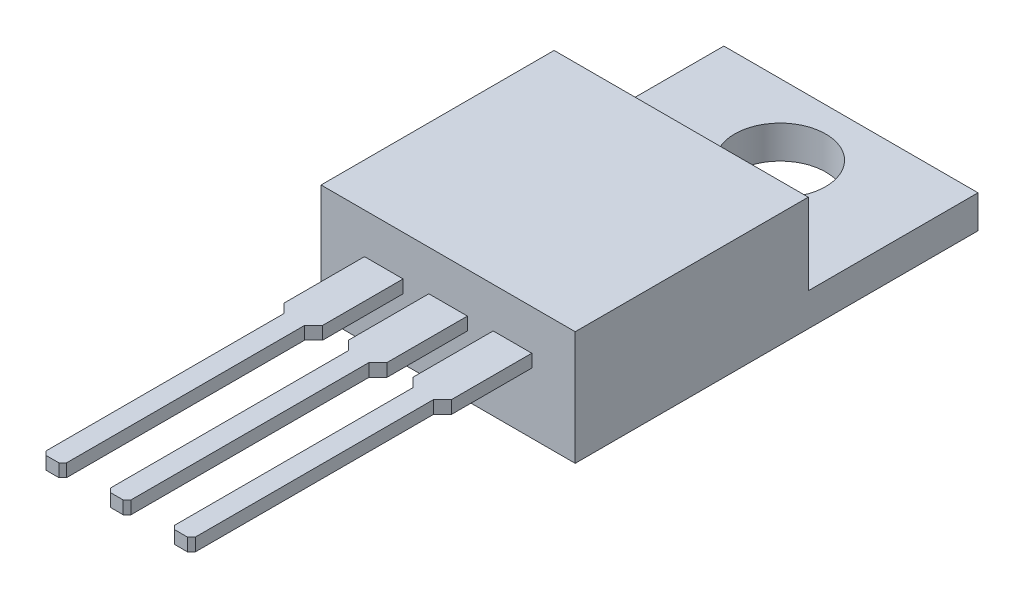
ISO-10303-21;
HEADER;
FILE_DESCRIPTION(('STEP AP214'),'2;1');
FILE_NAME('part.step','',(''),(''),'','','');
FILE_SCHEMA(('AUTOMOTIVE_DESIGN { 1 0 10303 214 1 1 1 1 }'));
ENDSEC;
DATA;
#1=APPLICATION_CONTEXT('core data for automotive mechanical design processes');
#2=APPLICATION_PROTOCOL_DEFINITION('international standard','automotive_design',2000,#1);
#3=PRODUCT_CONTEXT('',#1,'mechanical');
#4=PRODUCT('Part','Part','',(#3));
#5=PRODUCT_RELATED_PRODUCT_CATEGORY('part','',(#4));
#6=PRODUCT_DEFINITION_FORMATION('','',#4);
#7=PRODUCT_DEFINITION_CONTEXT('part definition',#1,'design');
#8=PRODUCT_DEFINITION('design','',#6,#7);
#9=PRODUCT_DEFINITION_SHAPE('','',#8);
#10=(LENGTH_UNIT() NAMED_UNIT(*) SI_UNIT(.MILLI.,.METRE.));
#11=(NAMED_UNIT(*) PLANE_ANGLE_UNIT() SI_UNIT($,.RADIAN.));
#12=(NAMED_UNIT(*) SI_UNIT($,.STERADIAN.) SOLID_ANGLE_UNIT());
#13=UNCERTAINTY_MEASURE_WITH_UNIT(LENGTH_MEASURE(1.E-05),#10,'distance_accuracy_value','');
#14=(GEOMETRIC_REPRESENTATION_CONTEXT(3) GLOBAL_UNCERTAINTY_ASSIGNED_CONTEXT((#13)) GLOBAL_UNIT_ASSIGNED_CONTEXT((#10,
#11,#12)) REPRESENTATION_CONTEXT('',''));
#15=CARTESIAN_POINT('',(0.,0.,0.));
#16=DIRECTION('',(0.,0.,1.));
#17=DIRECTION('',(1.,0.,0.));
#18=AXIS2_PLACEMENT_3D('',#15,#16,#17);
#19=CARTESIAN_POINT('',(-5.0165,1.30048,13.1064));
#20=DIRECTION('',(0.,0.,-1.));
#21=DIRECTION('',(-1.,0.,0.));
#22=AXIS2_PLACEMENT_3D('',#19,#20,#21);
#23=PLANE('',#22);
#24=DIRECTION('',(0.,-1.,0.));
#25=VECTOR('',#24,1.);
#26=CARTESIAN_POINT('',(-0.761999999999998,2.9083,13.1064));
#27=LINE('',#26,#25);
#28=CARTESIAN_POINT('',(-0.761999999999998,2.9083,13.1064));
#29=VERTEX_POINT('',#28);
#30=CARTESIAN_POINT('',(-0.761999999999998,2.4003,13.1064));
#31=VERTEX_POINT('',#30);
#32=EDGE_CURVE('E303',#29,#31,#27,.T.);
#33=ORIENTED_EDGE('',*,*,#32,.F.);
#34=DIRECTION('',(-1.,0.,0.));
#35=VECTOR('',#34,1.);
#36=CARTESIAN_POINT('',(-0.761999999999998,2.9083,13.1064));
#37=LINE('',#36,#35);
#38=CARTESIAN_POINT('',(0.762000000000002,2.9083,13.1064));
#39=VERTEX_POINT('',#38);
#40=EDGE_CURVE('E312',#39,#29,#37,.T.);
#41=ORIENTED_EDGE('',*,*,#40,.F.);
#42=DIRECTION('',(0.,1.,0.));
#43=VECTOR('',#42,1.);
#44=CARTESIAN_POINT('',(0.762000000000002,2.9083,13.1064));
#45=LINE('',#44,#43);
#46=CARTESIAN_POINT('',(0.762000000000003,2.4003,13.1064));
#47=VERTEX_POINT('',#46);
#48=EDGE_CURVE('E309',#47,#39,#45,.T.);
#49=ORIENTED_EDGE('',*,*,#48,.F.);
#50=DIRECTION('',(1.,0.,0.));
#51=VECTOR('',#50,1.);
#52=CARTESIAN_POINT('',(-0.761999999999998,2.4003,13.1064));
#53=LINE('',#52,#51);
#54=EDGE_CURVE('E306',#31,#47,#53,.T.);
#55=ORIENTED_EDGE('',*,*,#54,.F.);
#56=EDGE_LOOP('',(#33,#41,#49,#55));
#57=FACE_BOUND('',#56,.T.);
#58=DIRECTION('',(1.,0.,0.));
#59=VECTOR('',#58,1.);
#60=CARTESIAN_POINT('',(-5.0165,0.,13.1064));
#61=LINE('',#60,#59);
#62=CARTESIAN_POINT('',(-5.0165,0.,13.1064));
#63=VERTEX_POINT('',#62);
#64=CARTESIAN_POINT('',(5.0165,0.,13.1064));
#65=VERTEX_POINT('',#64);
#66=EDGE_CURVE('E1022',#63,#65,#61,.T.);
#67=ORIENTED_EDGE('',*,*,#66,.T.);
#68=DIRECTION('',(0.,-1.,0.));
#69=VECTOR('',#68,1.);
#70=CARTESIAN_POINT('',(5.0165,1.30048,13.1064));
#71=LINE('',#70,#69);
#72=CARTESIAN_POINT('',(5.0165,4.50088,13.1064));
#73=VERTEX_POINT('',#72);
#74=EDGE_CURVE('E1035',#73,#65,#71,.T.);
#75=ORIENTED_EDGE('',*,*,#74,.F.);
#76=DIRECTION('',(1.,0.,0.));
#77=VECTOR('',#76,1.);
#78=CARTESIAN_POINT('',(-5.0165,4.50088,13.1064));
#79=LINE('',#78,#77);
#80=CARTESIAN_POINT('',(-5.0165,4.50088,13.1064));
#81=VERTEX_POINT('',#80);
#82=EDGE_CURVE('E1006',#81,#73,#79,.T.);
#83=ORIENTED_EDGE('',*,*,#82,.F.);
#84=DIRECTION('',(0.,-1.,0.));
#85=VECTOR('',#84,1.);
#86=CARTESIAN_POINT('',(-5.0165,1.30048,13.1064));
#87=LINE('',#86,#85);
#88=EDGE_CURVE('E382',#81,#63,#87,.T.);
#89=ORIENTED_EDGE('',*,*,#88,.T.);
#90=EDGE_LOOP('',(#67,#75,#83,#89));
#91=FACE_BOUND('',#90,.T.);
#92=DIRECTION('',(0.,-1.,0.));
#93=VECTOR('',#92,1.);
#94=CARTESIAN_POINT('',(-3.302,2.9083,13.1064));
#95=LINE('',#94,#93);
#96=CARTESIAN_POINT('',(-3.302,2.9083,13.1064));
#97=VERTEX_POINT('',#96);
#98=CARTESIAN_POINT('',(-3.302,2.4003,13.1064));
#99=VERTEX_POINT('',#98);
#100=EDGE_CURVE('E329',#97,#99,#95,.T.);
#101=ORIENTED_EDGE('',*,*,#100,.F.);
#102=DIRECTION('',(-1.,0.,0.));
#103=VECTOR('',#102,1.);
#104=CARTESIAN_POINT('',(-3.302,2.9083,13.1064));
#105=LINE('',#104,#103);
#106=CARTESIAN_POINT('',(-1.778,2.9083,13.1064));
#107=VERTEX_POINT('',#106);
#108=EDGE_CURVE('E338',#107,#97,#105,.T.);
#109=ORIENTED_EDGE('',*,*,#108,.F.);
#110=DIRECTION('',(0.,1.,0.));
#111=VECTOR('',#110,1.);
#112=CARTESIAN_POINT('',(-1.778,2.9083,13.1064));
#113=LINE('',#112,#111);
#114=CARTESIAN_POINT('',(-1.778,2.4003,13.1064));
#115=VERTEX_POINT('',#114);
#116=EDGE_CURVE('E335',#115,#107,#113,.T.);
#117=ORIENTED_EDGE('',*,*,#116,.F.);
#118=DIRECTION('',(1.,0.,0.));
#119=VECTOR('',#118,1.);
#120=CARTESIAN_POINT('',(-3.302,2.4003,13.1064));
#121=LINE('',#120,#119);
#122=EDGE_CURVE('E332',#99,#115,#121,.T.);
#123=ORIENTED_EDGE('',*,*,#122,.F.);
#124=EDGE_LOOP('',(#101,#109,#117,#123));
#125=FACE_BOUND('',#124,.T.);
#126=DIRECTION('',(0.,-1.,0.));
#127=VECTOR('',#126,1.);
#128=CARTESIAN_POINT('',(1.778,2.9083,13.1064));
#129=LINE('',#128,#127);
#130=CARTESIAN_POINT('',(1.778,2.9083,13.1064));
#131=VERTEX_POINT('',#130);
#132=CARTESIAN_POINT('',(1.778,2.4003,13.1064));
#133=VERTEX_POINT('',#132);
#134=EDGE_CURVE('E499',#131,#133,#129,.T.);
#135=ORIENTED_EDGE('',*,*,#134,.F.);
#136=DIRECTION('',(-1.,0.,0.));
#137=VECTOR('',#136,1.);
#138=CARTESIAN_POINT('',(1.778,2.9083,13.1064));
#139=LINE('',#138,#137);
#140=CARTESIAN_POINT('',(3.302,2.9083,13.1064));
#141=VERTEX_POINT('',#140);
#142=EDGE_CURVE('E506',#141,#131,#139,.T.);
#143=ORIENTED_EDGE('',*,*,#142,.F.);
#144=DIRECTION('',(0.,1.,0.));
#145=VECTOR('',#144,1.);
#146=CARTESIAN_POINT('',(3.302,2.9083,13.1064));
#147=LINE('',#146,#145);
#148=CARTESIAN_POINT('',(3.302,2.4003,13.1064));
#149=VERTEX_POINT('',#148);
#150=EDGE_CURVE('E292',#149,#141,#147,.T.);
#151=ORIENTED_EDGE('',*,*,#150,.F.);
#152=DIRECTION('',(1.,0.,0.));
#153=VECTOR('',#152,1.);
#154=CARTESIAN_POINT('',(1.778,2.4003,13.1064));
#155=LINE('',#154,#153);
#156=EDGE_CURVE('E502',#133,#149,#155,.T.);
#157=ORIENTED_EDGE('',*,*,#156,.F.);
#158=EDGE_LOOP('',(#135,#143,#151,#157));
#159=FACE_BOUND('',#158,.T.);
#160=ADVANCED_FACE('F32',(#57,#91,#125,#159),#23,.F.);
#161=CARTESIAN_POINT('',(-5.0165,1.30048,-2.794));
#162=DIRECTION('',(1.,0.,0.));
#163=DIRECTION('',(0.,0.,-1.));
#164=AXIS2_PLACEMENT_3D('',#161,#162,#163);
#165=PLANE('',#164);
#166=DIRECTION('',(0.,0.,1.));
#167=VECTOR('',#166,1.);
#168=CARTESIAN_POINT('',(-5.0165,0.,-2.794));
#169=LINE('',#168,#167);
#170=CARTESIAN_POINT('',(-5.0165,0.,-2.794));
#171=VERTEX_POINT('',#170);
#172=EDGE_CURVE('E1019',#171,#63,#169,.T.);
#173=ORIENTED_EDGE('',*,*,#172,.T.);
#174=ORIENTED_EDGE('',*,*,#88,.F.);
#175=DIRECTION('',(0.,0.,1.));
#176=VECTOR('',#175,1.);
#177=CARTESIAN_POINT('',(-5.0165,4.50088,13.1064));
#178=LINE('',#177,#176);
#179=CARTESIAN_POINT('',(-5.0165,4.50088,3.90652));
#180=VERTEX_POINT('',#179);
#181=EDGE_CURVE('E358',#180,#81,#178,.T.);
#182=ORIENTED_EDGE('',*,*,#181,.F.);
#183=DIRECTION('',(0.,-1.,0.));
#184=VECTOR('',#183,1.);
#185=CARTESIAN_POINT('',(-5.0165,4.50088,3.90652));
#186=LINE('',#185,#184);
#187=CARTESIAN_POINT('',(-5.0165,1.30048,3.90652));
#188=VERTEX_POINT('',#187);
#189=EDGE_CURVE('E367',#180,#188,#186,.T.);
#190=ORIENTED_EDGE('',*,*,#189,.T.);
#191=DIRECTION('',(0.,0.,1.));
#192=VECTOR('',#191,1.);
#193=CARTESIAN_POINT('',(-5.0165,1.30048,-2.794));
#194=LINE('',#193,#192);
#195=CARTESIAN_POINT('',(-5.0165,1.30048,-2.794));
#196=VERTEX_POINT('',#195);
#197=EDGE_CURVE('E1028',#196,#188,#194,.T.);
#198=ORIENTED_EDGE('',*,*,#197,.F.);
#199=DIRECTION('',(0.,-1.,0.));
#200=VECTOR('',#199,1.);
#201=CARTESIAN_POINT('',(-5.0165,1.30048,-2.794));
#202=LINE('',#201,#200);
#203=EDGE_CURVE('E1041',#196,#171,#202,.T.);
#204=ORIENTED_EDGE('',*,*,#203,.T.);
#205=EDGE_LOOP('',(#173,#174,#182,#190,#198,#204));
#206=FACE_BOUND('',#205,.T.);
#207=ADVANCED_FACE('F34',(#206),#165,.F.);
#208=CARTESIAN_POINT('',(5.0165,1.30048,-2.794));
#209=DIRECTION('',(-1.,0.,0.));
#210=DIRECTION('',(0.,0.,1.));
#211=AXIS2_PLACEMENT_3D('',#208,#209,#210);
#212=PLANE('',#211);
#213=DIRECTION('',(0.,0.,-1.));
#214=VECTOR('',#213,1.);
#215=CARTESIAN_POINT('',(5.0165,0.,-2.794));
#216=LINE('',#215,#214);
#217=CARTESIAN_POINT('',(5.0165,0.,-2.794));
#218=VERTEX_POINT('',#217);
#219=EDGE_CURVE('E1024',#65,#218,#216,.T.);
#220=ORIENTED_EDGE('',*,*,#219,.T.);
#221=DIRECTION('',(0.,-1.,0.));
#222=VECTOR('',#221,1.);
#223=CARTESIAN_POINT('',(5.0165,1.30048,-2.794));
#224=LINE('',#223,#222);
#225=CARTESIAN_POINT('',(5.0165,1.30048,-2.794));
#226=VERTEX_POINT('',#225);
#227=EDGE_CURVE('E1038',#226,#218,#224,.T.);
#228=ORIENTED_EDGE('',*,*,#227,.F.);
#229=DIRECTION('',(0.,0.,-1.));
#230=VECTOR('',#229,1.);
#231=CARTESIAN_POINT('',(5.0165,1.30048,-2.794));
#232=LINE('',#231,#230);
#233=CARTESIAN_POINT('',(5.0165,1.30048,3.90652));
#234=VERTEX_POINT('',#233);
#235=EDGE_CURVE('E364',#234,#226,#232,.T.);
#236=ORIENTED_EDGE('',*,*,#235,.F.);
#237=DIRECTION('',(0.,-1.,0.));
#238=VECTOR('',#237,1.);
#239=CARTESIAN_POINT('',(5.0165,4.50088,3.90652));
#240=LINE('',#239,#238);
#241=CARTESIAN_POINT('',(5.0165,4.50088,3.90652));
#242=VERTEX_POINT('',#241);
#243=EDGE_CURVE('E370',#242,#234,#240,.T.);
#244=ORIENTED_EDGE('',*,*,#243,.F.);
#245=DIRECTION('',(0.,0.,-1.));
#246=VECTOR('',#245,1.);
#247=CARTESIAN_POINT('',(5.0165,4.50088,13.1064));
#248=LINE('',#247,#246);
#249=EDGE_CURVE('E1010',#73,#242,#248,.T.);
#250=ORIENTED_EDGE('',*,*,#249,.F.);
#251=ORIENTED_EDGE('',*,*,#74,.T.);
#252=EDGE_LOOP('',(#220,#228,#236,#244,#250,#251));
#253=FACE_BOUND('',#252,.T.);
#254=ADVANCED_FACE('F591',(#253),#212,.F.);
#255=CARTESIAN_POINT('',(-5.0165,1.30048,-2.794));
#256=DIRECTION('',(0.,0.,1.));
#257=DIRECTION('',(1.,0.,0.));
#258=AXIS2_PLACEMENT_3D('',#255,#256,#257);
#259=PLANE('',#258);
#260=DIRECTION('',(-1.,0.,0.));
#261=VECTOR('',#260,1.);
#262=CARTESIAN_POINT('',(-5.0165,0.,-2.794));
#263=LINE('',#262,#261);
#264=EDGE_CURVE('E1026',#218,#171,#263,.T.);
#265=ORIENTED_EDGE('',*,*,#264,.T.);
#266=ORIENTED_EDGE('',*,*,#203,.F.);
#267=DIRECTION('',(-1.,0.,0.));
#268=VECTOR('',#267,1.);
#269=CARTESIAN_POINT('',(-5.0165,1.30048,-2.794));
#270=LINE('',#269,#268);
#271=EDGE_CURVE('E1043',#226,#196,#270,.T.);
#272=ORIENTED_EDGE('',*,*,#271,.F.);
#273=ORIENTED_EDGE('',*,*,#227,.T.);
#274=EDGE_LOOP('',(#265,#266,#272,#273));
#275=FACE_BOUND('',#274,.T.);
#276=ADVANCED_FACE('F598',(#275),#259,.F.);
#277=CARTESIAN_POINT('',(-5.0165,1.30048,-2.794));
#278=DIRECTION('',(0.,1.,0.));
#279=DIRECTION('',(0.,0.,1.));
#280=AXIS2_PLACEMENT_3D('',#277,#278,#279);
#281=PLANE('',#280);
#282=DIRECTION('',(-1.,0.,0.));
#283=VECTOR('',#282,1.);
#284=CARTESIAN_POINT('',(-5.0165,1.30048,3.90652));
#285=LINE('',#284,#283);
#286=EDGE_CURVE('E355',#234,#188,#285,.T.);
#287=ORIENTED_EDGE('',*,*,#286,.F.);
#288=ORIENTED_EDGE('',*,*,#235,.T.);
#289=ORIENTED_EDGE('',*,*,#271,.T.);
#290=ORIENTED_EDGE('',*,*,#197,.T.);
#291=EDGE_LOOP('',(#287,#288,#289,#290));
#292=FACE_BOUND('',#291,.T.);
#293=CARTESIAN_POINT('',(0.,1.30048,0.));
#294=DIRECTION('',(0.,1.,0.));
#295=DIRECTION('',(0.,0.,1.));
#296=AXIS2_PLACEMENT_3D('',#293,#294,#295);
#297=CIRCLE('',#296,1.79959);
#298=CARTESIAN_POINT('',(0.,1.30048,1.79959));
#299=VERTEX_POINT('',#298);
#300=EDGE_CURVE('E376',#299,#299,#297,.T.);
#301=ORIENTED_EDGE('',*,*,#300,.F.);
#302=EDGE_LOOP('',(#301));
#303=FACE_BOUND('',#302,.T.);
#304=ADVANCED_FACE('F602',(#292,#303),#281,.T.);
#305=CARTESIAN_POINT('',(-5.0165,0.,-2.794));
#306=DIRECTION('',(0.,1.,0.));
#307=DIRECTION('',(0.,0.,1.));
#308=AXIS2_PLACEMENT_3D('',#305,#306,#307);
#309=PLANE('',#308);
#310=CARTESIAN_POINT('',(0.,0.,0.));
#311=DIRECTION('',(0.,1.,0.));
#312=DIRECTION('',(0.,0.,1.));
#313=AXIS2_PLACEMENT_3D('',#310,#311,#312);
#314=CIRCLE('',#313,1.79959);
#315=CARTESIAN_POINT('',(0.,0.,1.79959));
#316=VERTEX_POINT('',#315);
#317=EDGE_CURVE('E1016',#316,#316,#314,.T.);
#318=ORIENTED_EDGE('',*,*,#317,.T.);
#319=EDGE_LOOP('',(#318));
#320=FACE_BOUND('',#319,.T.);
#321=ORIENTED_EDGE('',*,*,#172,.F.);
#322=ORIENTED_EDGE('',*,*,#264,.F.);
#323=ORIENTED_EDGE('',*,*,#219,.F.);
#324=ORIENTED_EDGE('',*,*,#66,.F.);
#325=EDGE_LOOP('',(#321,#322,#323,#324));
#326=FACE_BOUND('',#325,.T.);
#327=ADVANCED_FACE('F606',(#320,#326),#309,.F.);
#328=CARTESIAN_POINT('',(0.,0.,0.));
#329=DIRECTION('',(0.,1.,0.));
#330=DIRECTION('',(0.,0.,1.));
#331=AXIS2_PLACEMENT_3D('',#328,#329,#330);
#332=CYLINDRICAL_SURFACE('',#331,1.79959);
#333=ORIENTED_EDGE('',*,*,#317,.F.);
#334=EDGE_LOOP('',(#333));
#335=FACE_BOUND('',#334,.T.);
#336=ORIENTED_EDGE('',*,*,#300,.T.);
#337=EDGE_LOOP('',(#336));
#338=FACE_BOUND('',#337,.T.);
#339=ADVANCED_FACE('F610',(#335,#338),#332,.F.);
#340=CARTESIAN_POINT('',(-5.0165,4.50088,3.90652));
#341=DIRECTION('',(0.,0.,1.));
#342=DIRECTION('',(1.,0.,0.));
#343=AXIS2_PLACEMENT_3D('',#340,#341,#342);
#344=PLANE('',#343);
#345=ORIENTED_EDGE('',*,*,#286,.T.);
#346=ORIENTED_EDGE('',*,*,#189,.F.);
#347=DIRECTION('',(-1.,0.,0.));
#348=VECTOR('',#347,1.);
#349=CARTESIAN_POINT('',(-5.0165,4.50088,3.90652));
#350=LINE('',#349,#348);
#351=EDGE_CURVE('E371',#242,#180,#350,.T.);
#352=ORIENTED_EDGE('',*,*,#351,.F.);
#353=ORIENTED_EDGE('',*,*,#243,.T.);
#354=EDGE_LOOP('',(#345,#346,#352,#353));
#355=FACE_BOUND('',#354,.T.);
#356=ADVANCED_FACE('F614',(#355),#344,.F.);
#357=CARTESIAN_POINT('',(-5.0165,4.50088,3.90652));
#358=DIRECTION('',(0.,-1.,0.));
#359=DIRECTION('',(0.,0.,-1.));
#360=AXIS2_PLACEMENT_3D('',#357,#358,#359);
#361=PLANE('',#360);
#362=ORIENTED_EDGE('',*,*,#181,.T.);
#363=ORIENTED_EDGE('',*,*,#82,.T.);
#364=ORIENTED_EDGE('',*,*,#249,.T.);
#365=ORIENTED_EDGE('',*,*,#351,.T.);
#366=EDGE_LOOP('',(#362,#363,#364,#365));
#367=FACE_BOUND('',#366,.T.);
#368=ADVANCED_FACE('F618',(#367),#361,.F.);
#369=CARTESIAN_POINT('',(-3.302,2.9083,26.1874));
#370=DIRECTION('',(1.,0.,0.));
#371=DIRECTION('',(0.,0.,-1.));
#372=AXIS2_PLACEMENT_3D('',#369,#370,#371);
#373=PLANE('',#372);
#374=DIRECTION('',(0.,0.,-1.));
#375=VECTOR('',#374,1.);
#376=CARTESIAN_POINT('',(-3.302,2.4003,26.1874));
#377=LINE('',#376,#375);
#378=CARTESIAN_POINT('',(-3.302,2.4003,16.2814));
#379=VERTEX_POINT('',#378);
#380=EDGE_CURVE('E353',#379,#99,#377,.T.);
#381=ORIENTED_EDGE('',*,*,#380,.F.);
#382=DIRECTION('',(0.,1.,0.));
#383=VECTOR('',#382,1.);
#384=CARTESIAN_POINT('',(-3.302,0.,16.2814));
#385=LINE('',#384,#383);
#386=CARTESIAN_POINT('',(-3.302,2.9083,16.2814));
#387=VERTEX_POINT('',#386);
#388=EDGE_CURVE('E421',#379,#387,#385,.T.);
#389=ORIENTED_EDGE('',*,*,#388,.T.);
#390=DIRECTION('',(0.,0.,-1.));
#391=VECTOR('',#390,1.);
#392=CARTESIAN_POINT('',(-3.302,2.9083,26.1874));
#393=LINE('',#392,#391);
#394=EDGE_CURVE('E347',#387,#97,#393,.T.);
#395=ORIENTED_EDGE('',*,*,#394,.T.);
#396=ORIENTED_EDGE('',*,*,#100,.T.);
#397=EDGE_LOOP('',(#381,#389,#395,#396));
#398=FACE_BOUND('',#397,.T.);
#399=ADVANCED_FACE('F572',(#398),#373,.F.);
#400=CARTESIAN_POINT('',(-3.302,2.4003,26.1874));
#401=DIRECTION('',(0.,1.,0.));
#402=DIRECTION('',(0.,0.,1.));
#403=AXIS2_PLACEMENT_3D('',#400,#401,#402);
#404=PLANE('',#403);
#405=DIRECTION('',(0.,0.,-1.));
#406=VECTOR('',#405,1.);
#407=CARTESIAN_POINT('',(-2.9464,2.4003,26.1874));
#408=LINE('',#407,#406);
#409=CARTESIAN_POINT('',(-2.9464,2.4003,26.035));
#410=VERTEX_POINT('',#409);
#411=CARTESIAN_POINT('',(-2.9464,2.4003,16.637));
#412=VERTEX_POINT('',#411);
#413=EDGE_CURVE('E494',#410,#412,#408,.T.);
#414=ORIENTED_EDGE('',*,*,#413,.T.);
#415=DIRECTION('',(-0.707106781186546,0.,-0.707106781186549));
#416=VECTOR('',#415,1.);
#417=CARTESIAN_POINT('',(1.651,2.4003,21.2344));
#418=LINE('',#417,#416);
#419=EDGE_CURVE('E496',#412,#379,#418,.T.);
#420=ORIENTED_EDGE('',*,*,#419,.T.);
#421=ORIENTED_EDGE('',*,*,#380,.T.);
#422=ORIENTED_EDGE('',*,*,#122,.T.);
#423=DIRECTION('',(0.,0.,-1.));
#424=VECTOR('',#423,1.);
#425=CARTESIAN_POINT('',(-1.778,2.4003,26.1874));
#426=LINE('',#425,#424);
#427=CARTESIAN_POINT('',(-1.778,2.4003,16.2814));
#428=VERTEX_POINT('',#427);
#429=EDGE_CURVE('E351',#428,#115,#426,.T.);
#430=ORIENTED_EDGE('',*,*,#429,.F.);
#431=DIRECTION('',(-0.707106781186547,0.,0.707106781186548));
#432=VECTOR('',#431,1.);
#433=CARTESIAN_POINT('',(-7.493,2.4003,21.9964));
#434=LINE('',#433,#432);
#435=CARTESIAN_POINT('',(-2.1336,2.4003,16.637));
#436=VERTEX_POINT('',#435);
#437=EDGE_CURVE('E491',#428,#436,#434,.T.);
#438=ORIENTED_EDGE('',*,*,#437,.T.);
#439=DIRECTION('',(0.,0.,1.));
#440=VECTOR('',#439,1.);
#441=CARTESIAN_POINT('',(-2.1336,2.4003,26.1874));
#442=LINE('',#441,#440);
#443=CARTESIAN_POINT('',(-2.1336,2.4003,26.035));
#444=VERTEX_POINT('',#443);
#445=EDGE_CURVE('E399',#436,#444,#442,.T.);
#446=ORIENTED_EDGE('',*,*,#445,.T.);
#447=DIRECTION('',(-0.707106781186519,0.,0.707106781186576));
#448=VECTOR('',#447,1.);
#449=CARTESIAN_POINT('',(-2.79399999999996,2.4003,26.6954));
#450=LINE('',#449,#448);
#451=CARTESIAN_POINT('',(-2.286,2.4003,26.1874));
#452=VERTEX_POINT('',#451);
#453=EDGE_CURVE('E389',#444,#452,#450,.T.);
#454=ORIENTED_EDGE('',*,*,#453,.T.);
#455=DIRECTION('',(1.,0.,0.));
#456=VECTOR('',#455,1.);
#457=CARTESIAN_POINT('',(-3.302,2.4003,26.1874));
#458=LINE('',#457,#456);
#459=CARTESIAN_POINT('',(-2.794,2.4003,26.1874));
#460=VERTEX_POINT('',#459);
#461=EDGE_CURVE('E341',#460,#452,#458,.T.);
#462=ORIENTED_EDGE('',*,*,#461,.F.);
#463=DIRECTION('',(-0.70710678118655,0.,-0.707106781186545));
#464=VECTOR('',#463,1.);
#465=CARTESIAN_POINT('',(-3.048,2.4003,25.9334));
#466=LINE('',#465,#464);
#467=EDGE_CURVE('E54',#460,#410,#466,.T.);
#468=ORIENTED_EDGE('',*,*,#467,.T.);
#469=EDGE_LOOP('',(#414,#420,#421,#422,#430,#438,#446,#454,#462,#468));
#470=FACE_BOUND('',#469,.T.);
#471=ADVANCED_FACE('F397',(#470),#404,.F.);
#472=CARTESIAN_POINT('',(-1.778,2.9083,26.1874));
#473=DIRECTION('',(-1.,0.,0.));
#474=DIRECTION('',(0.,-1.,0.));
#475=AXIS2_PLACEMENT_3D('',#472,#473,#474);
#476=PLANE('',#475);
#477=DIRECTION('',(0.,0.,-1.));
#478=VECTOR('',#477,1.);
#479=CARTESIAN_POINT('',(-1.778,2.9083,26.1874));
#480=LINE('',#479,#478);
#481=CARTESIAN_POINT('',(-1.778,2.9083,16.2814));
#482=VERTEX_POINT('',#481);
#483=EDGE_CURVE('E349',#482,#107,#480,.T.);
#484=ORIENTED_EDGE('',*,*,#483,.F.);
#485=DIRECTION('',(0.,1.,0.));
#486=VECTOR('',#485,1.);
#487=CARTESIAN_POINT('',(-1.778,0.,16.2814));
#488=LINE('',#487,#486);
#489=EDGE_CURVE('E433',#428,#482,#488,.T.);
#490=ORIENTED_EDGE('',*,*,#489,.F.);
#491=ORIENTED_EDGE('',*,*,#429,.T.);
#492=ORIENTED_EDGE('',*,*,#116,.T.);
#493=EDGE_LOOP('',(#484,#490,#491,#492));
#494=FACE_BOUND('',#493,.T.);
#495=ADVANCED_FACE('F563',(#494),#476,.F.);
#496=CARTESIAN_POINT('',(-3.302,2.9083,26.1874));
#497=DIRECTION('',(0.,-1.,0.));
#498=DIRECTION('',(0.,0.,-1.));
#499=AXIS2_PLACEMENT_3D('',#496,#497,#498);
#500=PLANE('',#499);
#501=ORIENTED_EDGE('',*,*,#394,.F.);
#502=DIRECTION('',(-0.707106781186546,0.,-0.707106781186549));
#503=VECTOR('',#502,1.);
#504=CARTESIAN_POINT('',(-2.9464,2.9083,16.637));
#505=LINE('',#504,#503);
#506=CARTESIAN_POINT('',(-2.9464,2.9083,16.637));
#507=VERTEX_POINT('',#506);
#508=EDGE_CURVE('E277',#507,#387,#505,.T.);
#509=ORIENTED_EDGE('',*,*,#508,.F.);
#510=DIRECTION('',(0.,0.,-1.));
#511=VECTOR('',#510,1.);
#512=CARTESIAN_POINT('',(-2.9464,2.9083,16.637));
#513=LINE('',#512,#511);
#514=CARTESIAN_POINT('',(-2.9464,2.9083,26.035));
#515=VERTEX_POINT('',#514);
#516=EDGE_CURVE('E413',#515,#507,#513,.T.);
#517=ORIENTED_EDGE('',*,*,#516,.F.);
#518=DIRECTION('',(-0.70710678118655,0.,-0.707106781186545));
#519=VECTOR('',#518,1.);
#520=CARTESIAN_POINT('',(-2.9464,2.9083,26.035));
#521=LINE('',#520,#519);
#522=CARTESIAN_POINT('',(-2.794,2.9083,26.1874));
#523=VERTEX_POINT('',#522);
#524=EDGE_CURVE('E406',#523,#515,#521,.T.);
#525=ORIENTED_EDGE('',*,*,#524,.F.);
#526=DIRECTION('',(-1.,0.,0.));
#527=VECTOR('',#526,1.);
#528=CARTESIAN_POINT('',(-3.302,2.9083,26.1874));
#529=LINE('',#528,#527);
#530=CARTESIAN_POINT('',(-2.286,2.9083,26.1874));
#531=VERTEX_POINT('',#530);
#532=EDGE_CURVE('E344',#531,#523,#529,.T.);
#533=ORIENTED_EDGE('',*,*,#532,.F.);
#534=DIRECTION('',(-0.707106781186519,0.,0.707106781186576));
#535=VECTOR('',#534,1.);
#536=CARTESIAN_POINT('',(-2.286,2.9083,26.1874));
#537=LINE('',#536,#535);
#538=CARTESIAN_POINT('',(-2.1336,2.9083,26.035));
#539=VERTEX_POINT('',#538);
#540=EDGE_CURVE('E47',#539,#531,#537,.T.);
#541=ORIENTED_EDGE('',*,*,#540,.F.);
#542=DIRECTION('',(0.,0.,1.));
#543=VECTOR('',#542,1.);
#544=CARTESIAN_POINT('',(-2.1336,2.9083,26.035));
#545=LINE('',#544,#543);
#546=CARTESIAN_POINT('',(-2.1336,2.9083,16.637));
#547=VERTEX_POINT('',#546);
#548=EDGE_CURVE('E416',#547,#539,#545,.T.);
#549=ORIENTED_EDGE('',*,*,#548,.F.);
#550=DIRECTION('',(-0.707106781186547,0.,0.707106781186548));
#551=VECTOR('',#550,1.);
#552=CARTESIAN_POINT('',(-1.778,2.9083,16.2814));
#553=LINE('',#552,#551);
#554=EDGE_CURVE('E550',#482,#547,#553,.T.);
#555=ORIENTED_EDGE('',*,*,#554,.F.);
#556=ORIENTED_EDGE('',*,*,#483,.T.);
#557=ORIENTED_EDGE('',*,*,#108,.T.);
#558=EDGE_LOOP('',(#501,#509,#517,#525,#533,#541,#549,#555,#556,#557));
#559=FACE_BOUND('',#558,.T.);
#560=ADVANCED_FACE('F410',(#559),#500,.F.);
#561=CARTESIAN_POINT('',(-3.302,2.4003,26.1874));
#562=DIRECTION('',(0.,0.,1.));
#563=DIRECTION('',(1.,0.,0.));
#564=AXIS2_PLACEMENT_3D('',#561,#562,#563);
#565=PLANE('',#564);
#566=DIRECTION('',(0.,1.,0.));
#567=VECTOR('',#566,1.);
#568=CARTESIAN_POINT('',(-2.794,2.4003,26.1874));
#569=LINE('',#568,#567);
#570=EDGE_CURVE('E11',#460,#523,#569,.T.);
#571=ORIENTED_EDGE('',*,*,#570,.F.);
#572=ORIENTED_EDGE('',*,*,#461,.T.);
#573=DIRECTION('',(0.,-1.,0.));
#574=VECTOR('',#573,1.);
#575=CARTESIAN_POINT('',(-2.286,2.4003,26.1874));
#576=LINE('',#575,#574);
#577=EDGE_CURVE('E40',#531,#452,#576,.T.);
#578=ORIENTED_EDGE('',*,*,#577,.F.);
#579=ORIENTED_EDGE('',*,*,#532,.T.);
#580=EDGE_LOOP('',(#571,#572,#578,#579));
#581=FACE_BOUND('',#580,.T.);
#582=ADVANCED_FACE('F402',(#581),#565,.T.);
#583=CARTESIAN_POINT('',(-0.761999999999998,2.9083,26.1874));
#584=DIRECTION('',(1.,0.,0.));
#585=DIRECTION('',(0.,1.,0.));
#586=AXIS2_PLACEMENT_3D('',#583,#584,#585);
#587=PLANE('',#586);
#588=DIRECTION('',(0.,0.,-1.));
#589=VECTOR('',#588,1.);
#590=CARTESIAN_POINT('',(-0.761999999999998,2.4003,26.1874));
#591=LINE('',#590,#589);
#592=CARTESIAN_POINT('',(-0.762000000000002,2.4003,16.2814));
#593=VERTEX_POINT('',#592);
#594=EDGE_CURVE('E327',#593,#31,#591,.T.);
#595=ORIENTED_EDGE('',*,*,#594,.F.);
#596=DIRECTION('',(0.,1.,0.));
#597=VECTOR('',#596,1.);
#598=CARTESIAN_POINT('',(-0.762000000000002,0.,16.2814));
#599=LINE('',#598,#597);
#600=CARTESIAN_POINT('',(-0.762000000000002,2.9083,16.2814));
#601=VERTEX_POINT('',#600);
#602=EDGE_CURVE('E435',#593,#601,#599,.T.);
#603=ORIENTED_EDGE('',*,*,#602,.T.);
#604=DIRECTION('',(0.,0.,-1.));
#605=VECTOR('',#604,1.);
#606=CARTESIAN_POINT('',(-0.761999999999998,2.9083,26.1874));
#607=LINE('',#606,#605);
#608=EDGE_CURVE('E321',#601,#29,#607,.T.);
#609=ORIENTED_EDGE('',*,*,#608,.T.);
#610=ORIENTED_EDGE('',*,*,#32,.T.);
#611=EDGE_LOOP('',(#595,#603,#609,#610));
#612=FACE_BOUND('',#611,.T.);
#613=ADVANCED_FACE('F633',(#612),#587,.F.);
#614=CARTESIAN_POINT('',(-0.761999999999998,2.4003,26.1874));
#615=DIRECTION('',(0.,1.,0.));
#616=DIRECTION('',(0.,0.,1.));
#617=AXIS2_PLACEMENT_3D('',#614,#615,#616);
#618=PLANE('',#617);
#619=DIRECTION('',(0.,0.,-1.));
#620=VECTOR('',#619,1.);
#621=CARTESIAN_POINT('',(-0.406400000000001,2.4003,26.1874));
#622=LINE('',#621,#620);
#623=CARTESIAN_POINT('',(-0.406400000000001,2.4003,26.035));
#624=VERTEX_POINT('',#623);
#625=CARTESIAN_POINT('',(-0.406400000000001,2.4003,16.637));
#626=VERTEX_POINT('',#625);
#627=EDGE_CURVE('E485',#624,#626,#622,.T.);
#628=ORIENTED_EDGE('',*,*,#627,.T.);
#629=DIRECTION('',(-0.707106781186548,0.,-0.707106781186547));
#630=VECTOR('',#629,1.);
#631=CARTESIAN_POINT('',(4.191,2.4003,21.2344));
#632=LINE('',#631,#630);
#633=EDGE_CURVE('E400',#626,#593,#632,.T.);
#634=ORIENTED_EDGE('',*,*,#633,.T.);
#635=ORIENTED_EDGE('',*,*,#594,.T.);
#636=ORIENTED_EDGE('',*,*,#54,.T.);
#637=DIRECTION('',(0.,0.,-1.));
#638=VECTOR('',#637,1.);
#639=CARTESIAN_POINT('',(0.762000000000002,2.4003,26.1874));
#640=LINE('',#639,#638);
#641=CARTESIAN_POINT('',(0.762000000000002,2.4003,16.2814));
#642=VERTEX_POINT('',#641);
#643=EDGE_CURVE('E325',#642,#47,#640,.T.);
#644=ORIENTED_EDGE('',*,*,#643,.F.);
#645=DIRECTION('',(-0.707106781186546,0.,0.707106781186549));
#646=VECTOR('',#645,1.);
#647=CARTESIAN_POINT('',(-4.95299999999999,2.4003,21.9964));
#648=LINE('',#647,#646);
#649=CARTESIAN_POINT('',(0.406399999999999,2.4003,16.637));
#650=VERTEX_POINT('',#649);
#651=EDGE_CURVE('E479',#642,#650,#648,.T.);
#652=ORIENTED_EDGE('',*,*,#651,.T.);
#653=DIRECTION('',(0.,0.,1.));
#654=VECTOR('',#653,1.);
#655=CARTESIAN_POINT('',(0.406399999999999,2.4003,26.1874));
#656=LINE('',#655,#654);
#657=CARTESIAN_POINT('',(0.406399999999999,2.4003,26.035));
#658=VERTEX_POINT('',#657);
#659=EDGE_CURVE('E482',#650,#658,#656,.T.);
#660=ORIENTED_EDGE('',*,*,#659,.T.);
#661=DIRECTION('',(-0.707106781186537,0.,0.707106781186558));
#662=VECTOR('',#661,1.);
#663=CARTESIAN_POINT('',(-0.253999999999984,2.4003,26.6954));
#664=LINE('',#663,#662);
#665=CARTESIAN_POINT('',(0.254,2.4003,26.1874));
#666=VERTEX_POINT('',#665);
#667=EDGE_CURVE('E473',#658,#666,#664,.T.);
#668=ORIENTED_EDGE('',*,*,#667,.T.);
#669=DIRECTION('',(1.,0.,0.));
#670=VECTOR('',#669,1.);
#671=CARTESIAN_POINT('',(-0.761999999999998,2.4003,26.1874));
#672=LINE('',#671,#670);
#673=CARTESIAN_POINT('',(-0.254,2.4003,26.1874));
#674=VERTEX_POINT('',#673);
#675=EDGE_CURVE('E315',#674,#666,#672,.T.);
#676=ORIENTED_EDGE('',*,*,#675,.F.);
#677=DIRECTION('',(-0.707106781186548,0.,-0.707106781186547));
#678=VECTOR('',#677,1.);
#679=CARTESIAN_POINT('',(-0.507999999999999,2.4003,25.9334));
#680=LINE('',#679,#678);
#681=EDGE_CURVE('E476',#674,#624,#680,.T.);
#682=ORIENTED_EDGE('',*,*,#681,.T.);
#683=EDGE_LOOP('',(#628,#634,#635,#636,#644,#652,#660,#668,#676,#682));
#684=FACE_BOUND('',#683,.T.);
#685=ADVANCED_FACE('F636',(#684),#618,.F.);
#686=CARTESIAN_POINT('',(0.762000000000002,2.9083,26.1874));
#687=DIRECTION('',(-1.,0.,0.));
#688=DIRECTION('',(0.,-1.,0.));
#689=AXIS2_PLACEMENT_3D('',#686,#687,#688);
#690=PLANE('',#689);
#691=DIRECTION('',(0.,0.,-1.));
#692=VECTOR('',#691,1.);
#693=CARTESIAN_POINT('',(0.762000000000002,2.9083,26.1874));
#694=LINE('',#693,#692);
#695=CARTESIAN_POINT('',(0.762000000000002,2.9083,16.2814));
#696=VERTEX_POINT('',#695);
#697=EDGE_CURVE('E323',#696,#39,#694,.T.);
#698=ORIENTED_EDGE('',*,*,#697,.F.);
#699=DIRECTION('',(0.,1.,0.));
#700=VECTOR('',#699,1.);
#701=CARTESIAN_POINT('',(0.762000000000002,0.,16.2814));
#702=LINE('',#701,#700);
#703=EDGE_CURVE('E446',#642,#696,#702,.T.);
#704=ORIENTED_EDGE('',*,*,#703,.F.);
#705=ORIENTED_EDGE('',*,*,#643,.T.);
#706=ORIENTED_EDGE('',*,*,#48,.T.);
#707=EDGE_LOOP('',(#698,#704,#705,#706));
#708=FACE_BOUND('',#707,.T.);
#709=ADVANCED_FACE('F640',(#708),#690,.F.);
#710=CARTESIAN_POINT('',(-0.761999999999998,2.9083,26.1874));
#711=DIRECTION('',(0.,-1.,0.));
#712=DIRECTION('',(0.,0.,-1.));
#713=AXIS2_PLACEMENT_3D('',#710,#711,#712);
#714=PLANE('',#713);
#715=ORIENTED_EDGE('',*,*,#608,.F.);
#716=DIRECTION('',(-0.707106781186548,0.,-0.707106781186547));
#717=VECTOR('',#716,1.);
#718=CARTESIAN_POINT('',(-0.406400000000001,2.9083,16.637));
#719=LINE('',#718,#717);
#720=CARTESIAN_POINT('',(-0.406400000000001,2.9083,16.637));
#721=VERTEX_POINT('',#720);
#722=EDGE_CURVE('E548',#721,#601,#719,.T.);
#723=ORIENTED_EDGE('',*,*,#722,.F.);
#724=DIRECTION('',(0.,0.,-1.));
#725=VECTOR('',#724,1.);
#726=CARTESIAN_POINT('',(-0.406400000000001,2.9083,16.637));
#727=LINE('',#726,#725);
#728=CARTESIAN_POINT('',(-0.406400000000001,2.9083,26.035));
#729=VERTEX_POINT('',#728);
#730=EDGE_CURVE('E545',#729,#721,#727,.T.);
#731=ORIENTED_EDGE('',*,*,#730,.F.);
#732=DIRECTION('',(-0.707106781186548,0.,-0.707106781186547));
#733=VECTOR('',#732,1.);
#734=CARTESIAN_POINT('',(-0.406400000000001,2.9083,26.035));
#735=LINE('',#734,#733);
#736=CARTESIAN_POINT('',(-0.254,2.9083,26.1874));
#737=VERTEX_POINT('',#736);
#738=EDGE_CURVE('E542',#737,#729,#735,.T.);
#739=ORIENTED_EDGE('',*,*,#738,.F.);
#740=DIRECTION('',(-1.,0.,0.));
#741=VECTOR('',#740,1.);
#742=CARTESIAN_POINT('',(-0.761999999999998,2.9083,26.1874));
#743=LINE('',#742,#741);
#744=CARTESIAN_POINT('',(0.254,2.9083,26.1874));
#745=VERTEX_POINT('',#744);
#746=EDGE_CURVE('E318',#745,#737,#743,.T.);
#747=ORIENTED_EDGE('',*,*,#746,.F.);
#748=DIRECTION('',(-0.707106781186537,0.,0.707106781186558));
#749=VECTOR('',#748,1.);
#750=CARTESIAN_POINT('',(0.254,2.9083,26.1874));
#751=LINE('',#750,#749);
#752=CARTESIAN_POINT('',(0.406399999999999,2.9083,26.035));
#753=VERTEX_POINT('',#752);
#754=EDGE_CURVE('E540',#753,#745,#751,.T.);
#755=ORIENTED_EDGE('',*,*,#754,.F.);
#756=DIRECTION('',(0.,0.,1.));
#757=VECTOR('',#756,1.);
#758=CARTESIAN_POINT('',(0.406399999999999,2.9083,26.035));
#759=LINE('',#758,#757);
#760=CARTESIAN_POINT('',(0.406399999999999,2.9083,16.637));
#761=VERTEX_POINT('',#760);
#762=EDGE_CURVE('E537',#761,#753,#759,.T.);
#763=ORIENTED_EDGE('',*,*,#762,.F.);
#764=DIRECTION('',(-0.707106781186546,0.,0.707106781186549));
#765=VECTOR('',#764,1.);
#766=CARTESIAN_POINT('',(0.762000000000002,2.9083,16.2814));
#767=LINE('',#766,#765);
#768=EDGE_CURVE('E534',#696,#761,#767,.T.);
#769=ORIENTED_EDGE('',*,*,#768,.F.);
#770=ORIENTED_EDGE('',*,*,#697,.T.);
#771=ORIENTED_EDGE('',*,*,#40,.T.);
#772=EDGE_LOOP('',(#715,#723,#731,#739,#747,#755,#763,#769,#770,#771));
#773=FACE_BOUND('',#772,.T.);
#774=ADVANCED_FACE('F644',(#773),#714,.F.);
#775=CARTESIAN_POINT('',(-0.761999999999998,2.4003,26.1874));
#776=DIRECTION('',(0.,0.,1.));
#777=DIRECTION('',(1.,0.,0.));
#778=AXIS2_PLACEMENT_3D('',#775,#776,#777);
#779=PLANE('',#778);
#780=DIRECTION('',(0.,1.,0.));
#781=VECTOR('',#780,1.);
#782=CARTESIAN_POINT('',(-0.254,2.4003,26.1874));
#783=LINE('',#782,#781);
#784=EDGE_CURVE('E386',#674,#737,#783,.T.);
#785=ORIENTED_EDGE('',*,*,#784,.F.);
#786=ORIENTED_EDGE('',*,*,#675,.T.);
#787=DIRECTION('',(0.,-1.,0.));
#788=VECTOR('',#787,1.);
#789=CARTESIAN_POINT('',(0.254,2.4003,26.1874));
#790=LINE('',#789,#788);
#791=EDGE_CURVE('E384',#745,#666,#790,.T.);
#792=ORIENTED_EDGE('',*,*,#791,.F.);
#793=ORIENTED_EDGE('',*,*,#746,.T.);
#794=EDGE_LOOP('',(#785,#786,#792,#793));
#795=FACE_BOUND('',#794,.T.);
#796=ADVANCED_FACE('F648',(#795),#779,.T.);
#797=CARTESIAN_POINT('',(1.778,2.9083,26.1874));
#798=DIRECTION('',(1.,0.,0.));
#799=DIRECTION('',(0.,1.,0.));
#800=AXIS2_PLACEMENT_3D('',#797,#798,#799);
#801=PLANE('',#800);
#802=DIRECTION('',(0.,0.,-1.));
#803=VECTOR('',#802,1.);
#804=CARTESIAN_POINT('',(1.778,2.4003,26.1874));
#805=LINE('',#804,#803);
#806=CARTESIAN_POINT('',(1.778,2.4003,16.2814));
#807=VERTEX_POINT('',#806);
#808=EDGE_CURVE('E296',#807,#133,#805,.T.);
#809=ORIENTED_EDGE('',*,*,#808,.F.);
#810=DIRECTION('',(0.,1.,0.));
#811=VECTOR('',#810,1.);
#812=CARTESIAN_POINT('',(1.778,0.,16.2814));
#813=LINE('',#812,#811);
#814=CARTESIAN_POINT('',(1.778,2.9083,16.2814));
#815=VERTEX_POINT('',#814);
#816=EDGE_CURVE('E448',#807,#815,#813,.T.);
#817=ORIENTED_EDGE('',*,*,#816,.T.);
#818=DIRECTION('',(0.,0.,-1.));
#819=VECTOR('',#818,1.);
#820=CARTESIAN_POINT('',(1.778,2.9083,26.1874));
#821=LINE('',#820,#819);
#822=EDGE_CURVE('E294',#815,#131,#821,.T.);
#823=ORIENTED_EDGE('',*,*,#822,.T.);
#824=ORIENTED_EDGE('',*,*,#134,.T.);
#825=EDGE_LOOP('',(#809,#817,#823,#824));
#826=FACE_BOUND('',#825,.T.);
#827=ADVANCED_FACE('F652',(#826),#801,.F.);
#828=CARTESIAN_POINT('',(1.778,2.4003,26.1874));
#829=DIRECTION('',(0.,1.,0.));
#830=DIRECTION('',(0.,0.,1.));
#831=AXIS2_PLACEMENT_3D('',#828,#829,#830);
#832=PLANE('',#831);
#833=DIRECTION('',(0.,0.,-1.));
#834=VECTOR('',#833,1.);
#835=CARTESIAN_POINT('',(2.1336,2.4003,26.1874));
#836=LINE('',#835,#834);
#837=CARTESIAN_POINT('',(2.1336,2.4003,26.035));
#838=VERTEX_POINT('',#837);
#839=CARTESIAN_POINT('',(2.1336,2.4003,16.637));
#840=VERTEX_POINT('',#839);
#841=EDGE_CURVE('E467',#838,#840,#836,.T.);
#842=ORIENTED_EDGE('',*,*,#841,.T.);
#843=DIRECTION('',(-0.707106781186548,0.,-0.707106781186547));
#844=VECTOR('',#843,1.);
#845=CARTESIAN_POINT('',(6.731,2.4003,21.2344));
#846=LINE('',#845,#844);
#847=EDGE_CURVE('E470',#840,#807,#846,.T.);
#848=ORIENTED_EDGE('',*,*,#847,.T.);
#849=ORIENTED_EDGE('',*,*,#808,.T.);
#850=ORIENTED_EDGE('',*,*,#156,.T.);
#851=DIRECTION('',(0.,0.,-1.));
#852=VECTOR('',#851,1.);
#853=CARTESIAN_POINT('',(3.302,2.4003,26.1874));
#854=LINE('',#853,#852);
#855=CARTESIAN_POINT('',(3.302,2.4003,16.2814));
#856=VERTEX_POINT('',#855);
#857=EDGE_CURVE('E293',#856,#149,#854,.T.);
#858=ORIENTED_EDGE('',*,*,#857,.F.);
#859=DIRECTION('',(-0.707106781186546,0.,0.707106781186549));
#860=VECTOR('',#859,1.);
#861=CARTESIAN_POINT('',(-2.41299999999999,2.4003,21.9964));
#862=LINE('',#861,#860);
#863=CARTESIAN_POINT('',(2.9464,2.4003,16.637));
#864=VERTEX_POINT('',#863);
#865=EDGE_CURVE('E272',#856,#864,#862,.T.);
#866=ORIENTED_EDGE('',*,*,#865,.T.);
#867=DIRECTION('',(0.,0.,1.));
#868=VECTOR('',#867,1.);
#869=CARTESIAN_POINT('',(2.9464,2.4003,26.1874));
#870=LINE('',#869,#868);
#871=CARTESIAN_POINT('',(2.9464,2.4003,26.035));
#872=VERTEX_POINT('',#871);
#873=EDGE_CURVE('E464',#864,#872,#870,.T.);
#874=ORIENTED_EDGE('',*,*,#873,.T.);
#875=DIRECTION('',(-0.707106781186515,0.,0.70710678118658));
#876=VECTOR('',#875,1.);
#877=CARTESIAN_POINT('',(2.28600000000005,2.4003,26.6954));
#878=LINE('',#877,#876);
#879=CARTESIAN_POINT('',(2.794,2.4003,26.1874));
#880=VERTEX_POINT('',#879);
#881=EDGE_CURVE('E424',#872,#880,#878,.T.);
#882=ORIENTED_EDGE('',*,*,#881,.T.);
#883=DIRECTION('',(1.,0.,0.));
#884=VECTOR('',#883,1.);
#885=CARTESIAN_POINT('',(1.778,2.4003,26.1874));
#886=LINE('',#885,#884);
#887=CARTESIAN_POINT('',(2.286,2.4003,26.1874));
#888=VERTEX_POINT('',#887);
#889=EDGE_CURVE('E508',#888,#880,#886,.T.);
#890=ORIENTED_EDGE('',*,*,#889,.F.);
#891=DIRECTION('',(-0.707106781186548,0.,-0.707106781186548));
#892=VECTOR('',#891,1.);
#893=CARTESIAN_POINT('',(2.032,2.4003,25.9334));
#894=LINE('',#893,#892);
#895=EDGE_CURVE('E460',#888,#838,#894,.T.);
#896=ORIENTED_EDGE('',*,*,#895,.T.);
#897=EDGE_LOOP('',(#842,#848,#849,#850,#858,#866,#874,#882,#890,#896));
#898=FACE_BOUND('',#897,.T.);
#899=ADVANCED_FACE('F656',(#898),#832,.F.);
#900=CARTESIAN_POINT('',(3.302,2.9083,26.1874));
#901=DIRECTION('',(-1.,0.,0.));
#902=DIRECTION('',(0.,0.,1.));
#903=AXIS2_PLACEMENT_3D('',#900,#901,#902);
#904=PLANE('',#903);
#905=DIRECTION('',(0.,0.,-1.));
#906=VECTOR('',#905,1.);
#907=CARTESIAN_POINT('',(3.302,2.9083,26.1874));
#908=LINE('',#907,#906);
#909=CARTESIAN_POINT('',(3.302,2.9083,16.2814));
#910=VERTEX_POINT('',#909);
#911=EDGE_CURVE('E283',#910,#141,#908,.T.);
#912=ORIENTED_EDGE('',*,*,#911,.F.);
#913=DIRECTION('',(0.,1.,0.));
#914=VECTOR('',#913,1.);
#915=CARTESIAN_POINT('',(3.302,0.,16.2814));
#916=LINE('',#915,#914);
#917=EDGE_CURVE('E265',#856,#910,#916,.T.);
#918=ORIENTED_EDGE('',*,*,#917,.F.);
#919=ORIENTED_EDGE('',*,*,#857,.T.);
#920=ORIENTED_EDGE('',*,*,#150,.T.);
#921=EDGE_LOOP('',(#912,#918,#919,#920));
#922=FACE_BOUND('',#921,.T.);
#923=ADVANCED_FACE('F290',(#922),#904,.F.);
#924=CARTESIAN_POINT('',(1.778,2.9083,26.1874));
#925=DIRECTION('',(0.,-1.,0.));
#926=DIRECTION('',(0.,0.,-1.));
#927=AXIS2_PLACEMENT_3D('',#924,#925,#926);
#928=PLANE('',#927);
#929=ORIENTED_EDGE('',*,*,#822,.F.);
#930=DIRECTION('',(-0.707106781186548,0.,-0.707106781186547));
#931=VECTOR('',#930,1.);
#932=CARTESIAN_POINT('',(2.1336,2.9083,16.637));
#933=LINE('',#932,#931);
#934=CARTESIAN_POINT('',(2.1336,2.9083,16.637));
#935=VERTEX_POINT('',#934);
#936=EDGE_CURVE('E528',#935,#815,#933,.T.);
#937=ORIENTED_EDGE('',*,*,#936,.F.);
#938=DIRECTION('',(0.,0.,-1.));
#939=VECTOR('',#938,1.);
#940=CARTESIAN_POINT('',(2.1336,2.9083,16.637));
#941=LINE('',#940,#939);
#942=CARTESIAN_POINT('',(2.1336,2.9083,26.035));
#943=VERTEX_POINT('',#942);
#944=EDGE_CURVE('E524',#943,#935,#941,.T.);
#945=ORIENTED_EDGE('',*,*,#944,.F.);
#946=DIRECTION('',(-0.707106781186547,0.,-0.707106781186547));
#947=VECTOR('',#946,1.);
#948=CARTESIAN_POINT('',(2.1336,2.9083,26.035));
#949=LINE('',#948,#947);
#950=CARTESIAN_POINT('',(2.286,2.9083,26.1874));
#951=VERTEX_POINT('',#950);
#952=EDGE_CURVE('E521',#951,#943,#949,.T.);
#953=ORIENTED_EDGE('',*,*,#952,.F.);
#954=DIRECTION('',(-1.,0.,0.));
#955=VECTOR('',#954,1.);
#956=CARTESIAN_POINT('',(1.778,2.9083,26.1874));
#957=LINE('',#956,#955);
#958=CARTESIAN_POINT('',(2.794,2.9083,26.1874));
#959=VERTEX_POINT('',#958);
#960=EDGE_CURVE('E298',#959,#951,#957,.T.);
#961=ORIENTED_EDGE('',*,*,#960,.F.);
#962=DIRECTION('',(-0.707106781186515,0.,0.70710678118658));
#963=VECTOR('',#962,1.);
#964=CARTESIAN_POINT('',(2.794,2.9083,26.1874));
#965=LINE('',#964,#963);
#966=CARTESIAN_POINT('',(2.9464,2.9083,26.035));
#967=VERTEX_POINT('',#966);
#968=EDGE_CURVE('E518',#967,#959,#965,.T.);
#969=ORIENTED_EDGE('',*,*,#968,.F.);
#970=DIRECTION('',(0.,0.,1.));
#971=VECTOR('',#970,1.);
#972=CARTESIAN_POINT('',(2.9464,2.9083,26.035));
#973=LINE('',#972,#971);
#974=CARTESIAN_POINT('',(2.9464,2.9083,16.637));
#975=VERTEX_POINT('',#974);
#976=EDGE_CURVE('E287',#975,#967,#973,.T.);
#977=ORIENTED_EDGE('',*,*,#976,.F.);
#978=DIRECTION('',(-0.707106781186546,0.,0.707106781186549));
#979=VECTOR('',#978,1.);
#980=CARTESIAN_POINT('',(3.302,2.9083,16.2814));
#981=LINE('',#980,#979);
#982=EDGE_CURVE('E269',#910,#975,#981,.T.);
#983=ORIENTED_EDGE('',*,*,#982,.F.);
#984=ORIENTED_EDGE('',*,*,#911,.T.);
#985=ORIENTED_EDGE('',*,*,#142,.T.);
#986=EDGE_LOOP('',(#929,#937,#945,#953,#961,#969,#977,#983,#984,#985));
#987=FACE_BOUND('',#986,.T.);
#988=ADVANCED_FACE('F281',(#987),#928,.F.);
#989=CARTESIAN_POINT('',(1.778,2.4003,26.1874));
#990=DIRECTION('',(0.,0.,1.));
#991=DIRECTION('',(1.,0.,0.));
#992=AXIS2_PLACEMENT_3D('',#989,#990,#991);
#993=PLANE('',#992);
#994=DIRECTION('',(0.,1.,0.));
#995=VECTOR('',#994,1.);
#996=CARTESIAN_POINT('',(2.286,2.4003,26.1874));
#997=LINE('',#996,#995);
#998=EDGE_CURVE('E381',#888,#951,#997,.T.);
#999=ORIENTED_EDGE('',*,*,#998,.F.);
#1000=ORIENTED_EDGE('',*,*,#889,.T.);
#1001=DIRECTION('',(0.,-1.,0.));
#1002=VECTOR('',#1001,1.);
#1003=CARTESIAN_POINT('',(2.794,2.4003,26.1874));
#1004=LINE('',#1003,#1002);
#1005=EDGE_CURVE('E379',#959,#880,#1004,.T.);
#1006=ORIENTED_EDGE('',*,*,#1005,.F.);
#1007=ORIENTED_EDGE('',*,*,#960,.T.);
#1008=EDGE_LOOP('',(#999,#1000,#1006,#1007));
#1009=FACE_BOUND('',#1008,.T.);
#1010=ADVANCED_FACE('F515',(#1009),#993,.T.);
#1011=CARTESIAN_POINT('',(2.794,0.,26.1874));
#1012=DIRECTION('',(-0.70710678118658,0.,-0.707106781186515));
#1013=DIRECTION('',(-0.707106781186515,0.,0.70710678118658));
#1014=AXIS2_PLACEMENT_3D('',#1011,#1012,#1013);
#1015=PLANE('',#1014);
#1016=DIRECTION('',(0.,1.,0.));
#1017=VECTOR('',#1016,1.);
#1018=CARTESIAN_POINT('',(2.9464,0.,26.035));
#1019=LINE('',#1018,#1017);
#1020=EDGE_CURVE('E455',#872,#967,#1019,.T.);
#1021=ORIENTED_EDGE('',*,*,#1020,.T.);
#1022=ORIENTED_EDGE('',*,*,#968,.T.);
#1023=ORIENTED_EDGE('',*,*,#1005,.T.);
#1024=ORIENTED_EDGE('',*,*,#881,.F.);
#1025=EDGE_LOOP('',(#1021,#1022,#1023,#1024));
#1026=FACE_BOUND('',#1025,.T.);
#1027=ADVANCED_FACE('F667',(#1026),#1015,.F.);
#1028=CARTESIAN_POINT('',(3.302,0.,16.2814));
#1029=DIRECTION('',(-0.707106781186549,0.,-0.707106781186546));
#1030=DIRECTION('',(-0.707106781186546,0.,0.707106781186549));
#1031=AXIS2_PLACEMENT_3D('',#1028,#1029,#1030);
#1032=PLANE('',#1031);
#1033=ORIENTED_EDGE('',*,*,#917,.T.);
#1034=ORIENTED_EDGE('',*,*,#982,.T.);
#1035=DIRECTION('',(0.,1.,0.));
#1036=VECTOR('',#1035,1.);
#1037=CARTESIAN_POINT('',(2.9464,0.,16.637));
#1038=LINE('',#1037,#1036);
#1039=EDGE_CURVE('E276',#864,#975,#1038,.T.);
#1040=ORIENTED_EDGE('',*,*,#1039,.F.);
#1041=ORIENTED_EDGE('',*,*,#865,.F.);
#1042=EDGE_LOOP('',(#1033,#1034,#1040,#1041));
#1043=FACE_BOUND('',#1042,.T.);
#1044=ADVANCED_FACE('F267',(#1043),#1032,.F.);
#1045=CARTESIAN_POINT('',(2.9464,0.,26.035));
#1046=DIRECTION('',(-1.,0.,0.));
#1047=DIRECTION('',(0.,0.,1.));
#1048=AXIS2_PLACEMENT_3D('',#1045,#1046,#1047);
#1049=PLANE('',#1048);
#1050=ORIENTED_EDGE('',*,*,#1039,.T.);
#1051=ORIENTED_EDGE('',*,*,#976,.T.);
#1052=ORIENTED_EDGE('',*,*,#1020,.F.);
#1053=ORIENTED_EDGE('',*,*,#873,.F.);
#1054=EDGE_LOOP('',(#1050,#1051,#1052,#1053));
#1055=FACE_BOUND('',#1054,.T.);
#1056=ADVANCED_FACE('F670',(#1055),#1049,.F.);
#1057=CARTESIAN_POINT('',(2.1336,0.,26.035));
#1058=DIRECTION('',(0.707106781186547,0.,-0.707106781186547));
#1059=DIRECTION('',(-0.707106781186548,0.,-0.707106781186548));
#1060=AXIS2_PLACEMENT_3D('',#1057,#1058,#1059);
#1061=PLANE('',#1060);
#1062=ORIENTED_EDGE('',*,*,#998,.T.);
#1063=ORIENTED_EDGE('',*,*,#952,.T.);
#1064=DIRECTION('',(0.,1.,0.));
#1065=VECTOR('',#1064,1.);
#1066=CARTESIAN_POINT('',(2.1336,0.,26.035));
#1067=LINE('',#1066,#1065);
#1068=EDGE_CURVE('E453',#838,#943,#1067,.T.);
#1069=ORIENTED_EDGE('',*,*,#1068,.F.);
#1070=ORIENTED_EDGE('',*,*,#895,.F.);
#1071=EDGE_LOOP('',(#1062,#1063,#1069,#1070));
#1072=FACE_BOUND('',#1071,.T.);
#1073=ADVANCED_FACE('F673',(#1072),#1061,.F.);
#1074=CARTESIAN_POINT('',(2.1336,0.,16.637));
#1075=DIRECTION('',(1.,0.,0.));
#1076=DIRECTION('',(0.,0.,-1.));
#1077=AXIS2_PLACEMENT_3D('',#1074,#1075,#1076);
#1078=PLANE('',#1077);
#1079=ORIENTED_EDGE('',*,*,#1068,.T.);
#1080=ORIENTED_EDGE('',*,*,#944,.T.);
#1081=DIRECTION('',(0.,1.,0.));
#1082=VECTOR('',#1081,1.);
#1083=CARTESIAN_POINT('',(2.1336,0.,16.637));
#1084=LINE('',#1083,#1082);
#1085=EDGE_CURVE('E451',#840,#935,#1084,.T.);
#1086=ORIENTED_EDGE('',*,*,#1085,.F.);
#1087=ORIENTED_EDGE('',*,*,#841,.F.);
#1088=EDGE_LOOP('',(#1079,#1080,#1086,#1087));
#1089=FACE_BOUND('',#1088,.T.);
#1090=ADVANCED_FACE('F680',(#1089),#1078,.F.);
#1091=CARTESIAN_POINT('',(2.1336,0.,16.637));
#1092=DIRECTION('',(0.707106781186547,0.,-0.707106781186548));
#1093=DIRECTION('',(-0.707106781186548,0.,-0.707106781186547));
#1094=AXIS2_PLACEMENT_3D('',#1091,#1092,#1093);
#1095=PLANE('',#1094);
#1096=ORIENTED_EDGE('',*,*,#1085,.T.);
#1097=ORIENTED_EDGE('',*,*,#936,.T.);
#1098=ORIENTED_EDGE('',*,*,#816,.F.);
#1099=ORIENTED_EDGE('',*,*,#847,.F.);
#1100=EDGE_LOOP('',(#1096,#1097,#1098,#1099));
#1101=FACE_BOUND('',#1100,.T.);
#1102=ADVANCED_FACE('F683',(#1101),#1095,.F.);
#1103=CARTESIAN_POINT('',(0.254,0.,26.1874));
#1104=DIRECTION('',(-0.707106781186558,0.,-0.707106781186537));
#1105=DIRECTION('',(-0.707106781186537,0.,0.707106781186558));
#1106=AXIS2_PLACEMENT_3D('',#1103,#1104,#1105);
#1107=PLANE('',#1106);
#1108=DIRECTION('',(0.,1.,0.));
#1109=VECTOR('',#1108,1.);
#1110=CARTESIAN_POINT('',(0.406399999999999,0.,26.035));
#1111=LINE('',#1110,#1109);
#1112=EDGE_CURVE('E442',#658,#753,#1111,.T.);
#1113=ORIENTED_EDGE('',*,*,#1112,.T.);
#1114=ORIENTED_EDGE('',*,*,#754,.T.);
#1115=ORIENTED_EDGE('',*,*,#791,.T.);
#1116=ORIENTED_EDGE('',*,*,#667,.F.);
#1117=EDGE_LOOP('',(#1113,#1114,#1115,#1116));
#1118=FACE_BOUND('',#1117,.T.);
#1119=ADVANCED_FACE('F687',(#1118),#1107,.F.);
#1120=CARTESIAN_POINT('',(0.762000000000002,0.,16.2814));
#1121=DIRECTION('',(-0.707106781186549,0.,-0.707106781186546));
#1122=DIRECTION('',(-0.707106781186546,0.,0.707106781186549));
#1123=AXIS2_PLACEMENT_3D('',#1120,#1121,#1122);
#1124=PLANE('',#1123);
#1125=ORIENTED_EDGE('',*,*,#703,.T.);
#1126=ORIENTED_EDGE('',*,*,#768,.T.);
#1127=DIRECTION('',(0.,1.,0.));
#1128=VECTOR('',#1127,1.);
#1129=CARTESIAN_POINT('',(0.406399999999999,0.,16.637));
#1130=LINE('',#1129,#1128);
#1131=EDGE_CURVE('E444',#650,#761,#1130,.T.);
#1132=ORIENTED_EDGE('',*,*,#1131,.F.);
#1133=ORIENTED_EDGE('',*,*,#651,.F.);
#1134=EDGE_LOOP('',(#1125,#1126,#1132,#1133));
#1135=FACE_BOUND('',#1134,.T.);
#1136=ADVANCED_FACE('F689',(#1135),#1124,.F.);
#1137=CARTESIAN_POINT('',(0.406399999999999,0.,26.035));
#1138=DIRECTION('',(-1.,0.,0.));
#1139=DIRECTION('',(0.,0.,1.));
#1140=AXIS2_PLACEMENT_3D('',#1137,#1138,#1139);
#1141=PLANE('',#1140);
#1142=ORIENTED_EDGE('',*,*,#1131,.T.);
#1143=ORIENTED_EDGE('',*,*,#762,.T.);
#1144=ORIENTED_EDGE('',*,*,#1112,.F.);
#1145=ORIENTED_EDGE('',*,*,#659,.F.);
#1146=EDGE_LOOP('',(#1142,#1143,#1144,#1145));
#1147=FACE_BOUND('',#1146,.T.);
#1148=ADVANCED_FACE('F692',(#1147),#1141,.F.);
#1149=CARTESIAN_POINT('',(-0.406400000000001,0.,26.035));
#1150=DIRECTION('',(0.707106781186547,0.,-0.707106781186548));
#1151=DIRECTION('',(-0.707106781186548,0.,-0.707106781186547));
#1152=AXIS2_PLACEMENT_3D('',#1149,#1150,#1151);
#1153=PLANE('',#1152);
#1154=ORIENTED_EDGE('',*,*,#784,.T.);
#1155=ORIENTED_EDGE('',*,*,#738,.T.);
#1156=DIRECTION('',(0.,1.,0.));
#1157=VECTOR('',#1156,1.);
#1158=CARTESIAN_POINT('',(-0.406400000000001,0.,26.035));
#1159=LINE('',#1158,#1157);
#1160=EDGE_CURVE('E440',#624,#729,#1159,.T.);
#1161=ORIENTED_EDGE('',*,*,#1160,.F.);
#1162=ORIENTED_EDGE('',*,*,#681,.F.);
#1163=EDGE_LOOP('',(#1154,#1155,#1161,#1162));
#1164=FACE_BOUND('',#1163,.T.);
#1165=ADVANCED_FACE('F696',(#1164),#1153,.F.);
#1166=CARTESIAN_POINT('',(-0.406400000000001,0.,16.637));
#1167=DIRECTION('',(1.,0.,0.));
#1168=DIRECTION('',(0.,0.,-1.));
#1169=AXIS2_PLACEMENT_3D('',#1166,#1167,#1168);
#1170=PLANE('',#1169);
#1171=ORIENTED_EDGE('',*,*,#1160,.T.);
#1172=ORIENTED_EDGE('',*,*,#730,.T.);
#1173=DIRECTION('',(0.,1.,0.));
#1174=VECTOR('',#1173,1.);
#1175=CARTESIAN_POINT('',(-0.406400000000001,0.,16.637));
#1176=LINE('',#1175,#1174);
#1177=EDGE_CURVE('E438',#626,#721,#1176,.T.);
#1178=ORIENTED_EDGE('',*,*,#1177,.F.);
#1179=ORIENTED_EDGE('',*,*,#627,.F.);
#1180=EDGE_LOOP('',(#1171,#1172,#1178,#1179));
#1181=FACE_BOUND('',#1180,.T.);
#1182=ADVANCED_FACE('F703',(#1181),#1170,.F.);
#1183=CARTESIAN_POINT('',(-0.406400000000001,0.,16.637));
#1184=DIRECTION('',(0.707106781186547,0.,-0.707106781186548));
#1185=DIRECTION('',(-0.707106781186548,0.,-0.707106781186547));
#1186=AXIS2_PLACEMENT_3D('',#1183,#1184,#1185);
#1187=PLANE('',#1186);
#1188=ORIENTED_EDGE('',*,*,#1177,.T.);
#1189=ORIENTED_EDGE('',*,*,#722,.T.);
#1190=ORIENTED_EDGE('',*,*,#602,.F.);
#1191=ORIENTED_EDGE('',*,*,#633,.F.);
#1192=EDGE_LOOP('',(#1188,#1189,#1190,#1191));
#1193=FACE_BOUND('',#1192,.T.);
#1194=ADVANCED_FACE('F707',(#1193),#1187,.F.);
#1195=CARTESIAN_POINT('',(-2.286,0.,26.1874));
#1196=DIRECTION('',(-0.707106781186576,0.,-0.707106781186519));
#1197=DIRECTION('',(-0.707106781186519,0.,0.707106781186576));
#1198=AXIS2_PLACEMENT_3D('',#1195,#1196,#1197);
#1199=PLANE('',#1198);
#1200=DIRECTION('',(0.,1.,0.));
#1201=VECTOR('',#1200,1.);
#1202=CARTESIAN_POINT('',(-2.1336,0.,26.035));
#1203=LINE('',#1202,#1201);
#1204=EDGE_CURVE('E429',#444,#539,#1203,.T.);
#1205=ORIENTED_EDGE('',*,*,#1204,.T.);
#1206=ORIENTED_EDGE('',*,*,#540,.T.);
#1207=ORIENTED_EDGE('',*,*,#577,.T.);
#1208=ORIENTED_EDGE('',*,*,#453,.F.);
#1209=EDGE_LOOP('',(#1205,#1206,#1207,#1208));
#1210=FACE_BOUND('',#1209,.T.);
#1211=ADVANCED_FACE('F388',(#1210),#1199,.F.);
#1212=CARTESIAN_POINT('',(-1.778,0.,16.2814));
#1213=DIRECTION('',(-0.707106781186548,0.,-0.707106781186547));
#1214=DIRECTION('',(-0.707106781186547,0.,0.707106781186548));
#1215=AXIS2_PLACEMENT_3D('',#1212,#1213,#1214);
#1216=PLANE('',#1215);
#1217=ORIENTED_EDGE('',*,*,#489,.T.);
#1218=ORIENTED_EDGE('',*,*,#554,.T.);
#1219=DIRECTION('',(0.,1.,0.));
#1220=VECTOR('',#1219,1.);
#1221=CARTESIAN_POINT('',(-2.1336,0.,16.637));
#1222=LINE('',#1221,#1220);
#1223=EDGE_CURVE('E431',#436,#547,#1222,.T.);
#1224=ORIENTED_EDGE('',*,*,#1223,.F.);
#1225=ORIENTED_EDGE('',*,*,#437,.F.);
#1226=EDGE_LOOP('',(#1217,#1218,#1224,#1225));
#1227=FACE_BOUND('',#1226,.T.);
#1228=ADVANCED_FACE('F712',(#1227),#1216,.F.);
#1229=CARTESIAN_POINT('',(-2.1336,0.,26.035));
#1230=DIRECTION('',(-1.,0.,0.));
#1231=DIRECTION('',(0.,0.,1.));
#1232=AXIS2_PLACEMENT_3D('',#1229,#1230,#1231);
#1233=PLANE('',#1232);
#1234=ORIENTED_EDGE('',*,*,#1223,.T.);
#1235=ORIENTED_EDGE('',*,*,#548,.T.);
#1236=ORIENTED_EDGE('',*,*,#1204,.F.);
#1237=ORIENTED_EDGE('',*,*,#445,.F.);
#1238=EDGE_LOOP('',(#1234,#1235,#1236,#1237));
#1239=FACE_BOUND('',#1238,.T.);
#1240=ADVANCED_FACE('F555',(#1239),#1233,.F.);
#1241=CARTESIAN_POINT('',(-2.9464,0.,16.637));
#1242=DIRECTION('',(0.707106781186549,0.,-0.707106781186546));
#1243=DIRECTION('',(-0.707106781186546,0.,-0.707106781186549));
#1244=AXIS2_PLACEMENT_3D('',#1241,#1242,#1243);
#1245=PLANE('',#1244);
#1246=DIRECTION('',(0.,1.,0.));
#1247=VECTOR('',#1246,1.);
#1248=CARTESIAN_POINT('',(-2.9464,0.,16.637));
#1249=LINE('',#1248,#1247);
#1250=EDGE_CURVE('E425',#412,#507,#1249,.T.);
#1251=ORIENTED_EDGE('',*,*,#1250,.T.);
#1252=ORIENTED_EDGE('',*,*,#508,.T.);
#1253=ORIENTED_EDGE('',*,*,#388,.F.);
#1254=ORIENTED_EDGE('',*,*,#419,.F.);
#1255=EDGE_LOOP('',(#1251,#1252,#1253,#1254));
#1256=FACE_BOUND('',#1255,.T.);
#1257=ADVANCED_FACE('F574',(#1256),#1245,.F.);
#1258=CARTESIAN_POINT('',(-2.9464,0.,16.637));
#1259=DIRECTION('',(1.,0.,0.));
#1260=DIRECTION('',(0.,0.,-1.));
#1261=AXIS2_PLACEMENT_3D('',#1258,#1259,#1260);
#1262=PLANE('',#1261);
#1263=DIRECTION('',(0.,1.,0.));
#1264=VECTOR('',#1263,1.);
#1265=CARTESIAN_POINT('',(-2.9464,0.,26.035));
#1266=LINE('',#1265,#1264);
#1267=EDGE_CURVE('E427',#410,#515,#1266,.T.);
#1268=ORIENTED_EDGE('',*,*,#1267,.T.);
#1269=ORIENTED_EDGE('',*,*,#516,.T.);
#1270=ORIENTED_EDGE('',*,*,#1250,.F.);
#1271=ORIENTED_EDGE('',*,*,#413,.F.);
#1272=EDGE_LOOP('',(#1268,#1269,#1270,#1271));
#1273=FACE_BOUND('',#1272,.T.);
#1274=ADVANCED_FACE('F577',(#1273),#1262,.F.);
#1275=CARTESIAN_POINT('',(-2.9464,0.,26.035));
#1276=DIRECTION('',(0.707106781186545,0.,-0.70710678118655));
#1277=DIRECTION('',(-0.70710678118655,0.,-0.707106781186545));
#1278=AXIS2_PLACEMENT_3D('',#1275,#1276,#1277);
#1279=PLANE('',#1278);
#1280=ORIENTED_EDGE('',*,*,#570,.T.);
#1281=ORIENTED_EDGE('',*,*,#524,.T.);
#1282=ORIENTED_EDGE('',*,*,#1267,.F.);
#1283=ORIENTED_EDGE('',*,*,#467,.F.);
#1284=EDGE_LOOP('',(#1280,#1281,#1282,#1283));
#1285=FACE_BOUND('',#1284,.T.);
#1286=ADVANCED_FACE('F405',(#1285),#1279,.F.);
#1287=CLOSED_SHELL('',(#160,#207,#254,#276,#304,#327,#339,#356,#368,#399,#471,#495,#560,#582,
#613,#685,#709,#774,#796,#827,#899,#923,#988,#1010,#1027,#1044,#1056,#1073,#1090,#1102,#1119,
#1136,#1148,#1165,#1182,#1194,#1211,#1228,#1240,#1257,#1274,#1286));
#1288=MANIFOLD_SOLID_BREP('B2',#1287);
#1289=ADVANCED_BREP_SHAPE_REPRESENTATION('',(#18,#1288),#14);
#1290=SHAPE_DEFINITION_REPRESENTATION(#9,#1289);
ENDSEC;
END-ISO-10303-21;
